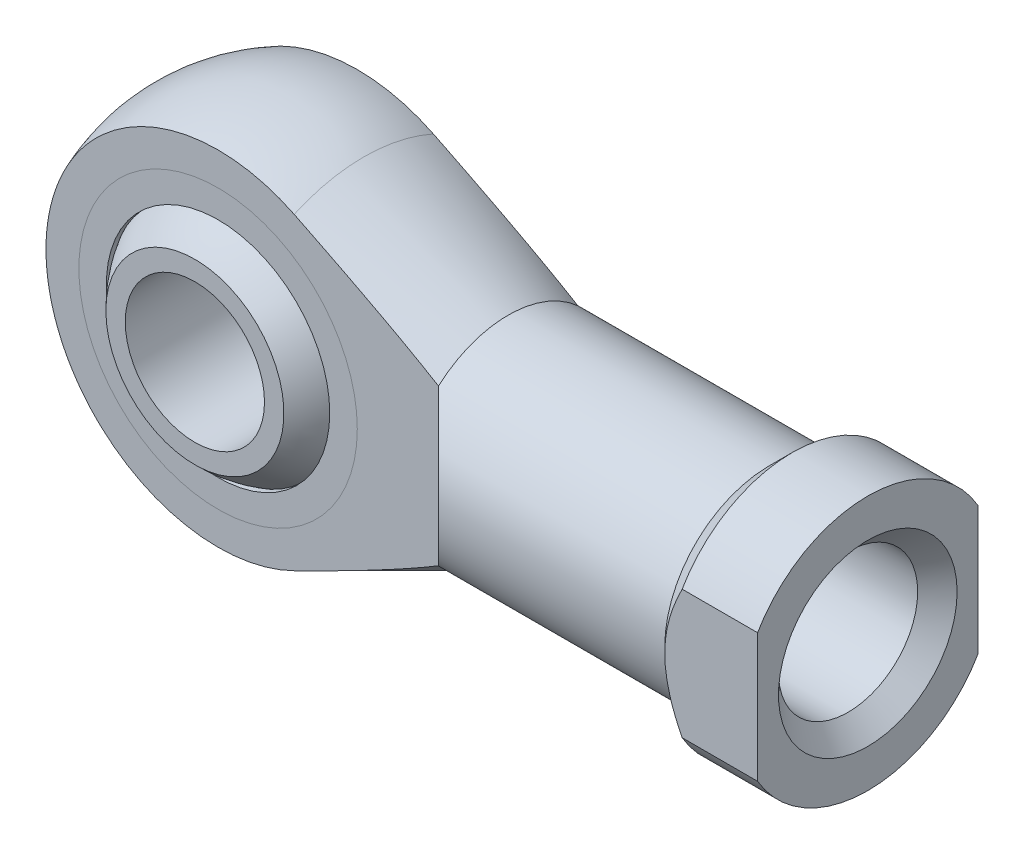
ISO-10303-21;
HEADER;
FILE_DESCRIPTION(('STEP AP214'),'2;1');
FILE_NAME('part.step','',(''),(''),'','','');
FILE_SCHEMA(('AUTOMOTIVE_DESIGN { 1 0 10303 214 1 1 1 1 }'));
ENDSEC;
DATA;
#1=APPLICATION_CONTEXT('core data for automotive mechanical design processes');
#2=APPLICATION_PROTOCOL_DEFINITION('international standard','automotive_design',2000,#1);
#3=PRODUCT_CONTEXT('',#1,'mechanical');
#4=PRODUCT('Part','Part','',(#3));
#5=PRODUCT_RELATED_PRODUCT_CATEGORY('part','',(#4));
#6=PRODUCT_DEFINITION_FORMATION('','',#4);
#7=PRODUCT_DEFINITION_CONTEXT('part definition',#1,'design');
#8=PRODUCT_DEFINITION('design','',#6,#7);
#9=PRODUCT_DEFINITION_SHAPE('','',#8);
#10=(LENGTH_UNIT() NAMED_UNIT(*) SI_UNIT(.MILLI.,.METRE.));
#11=(NAMED_UNIT(*) PLANE_ANGLE_UNIT() SI_UNIT($,.RADIAN.));
#12=(NAMED_UNIT(*) SI_UNIT($,.STERADIAN.) SOLID_ANGLE_UNIT());
#13=UNCERTAINTY_MEASURE_WITH_UNIT(LENGTH_MEASURE(1.E-05),#10,'distance_accuracy_value','');
#14=(GEOMETRIC_REPRESENTATION_CONTEXT(3) GLOBAL_UNCERTAINTY_ASSIGNED_CONTEXT((#13)) GLOBAL_UNIT_ASSIGNED_CONTEXT((#10,
#11,#12)) REPRESENTATION_CONTEXT('',''));
#15=CARTESIAN_POINT('',(0.,0.,0.));
#16=DIRECTION('',(0.,0.,1.));
#17=DIRECTION('',(1.,0.,0.));
#18=AXIS2_PLACEMENT_3D('',#15,#16,#17);
#19=CARTESIAN_POINT('',(0.,0.,0.));
#20=DIRECTION('',(0.,1.,0.));
#21=DIRECTION('',(1.,0.,0.));
#22=AXIS2_PLACEMENT_3D('',#19,#20,#21);
#23=SPHERICAL_SURFACE('',#22,11.085);
#24=CARTESIAN_POINT('',(0.,0.,0.));
#25=DIRECTION('',(0.,0.,-1.));
#26=DIRECTION('',(-1.,0.,0.));
#27=AXIS2_PLACEMENT_3D('',#24,#25,#26);
#28=SPHERICAL_SURFACE('',#27,11.085);
#29=CARTESIAN_POINT('',(0.,0.,8.));
#30=DIRECTION('',(0.,0.,-1.));
#31=DIRECTION('',(-1.,0.,0.));
#32=AXIS2_PLACEMENT_3D('',#29,#30,#31);
#33=CIRCLE('',#32,7.67314961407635);
#34=CARTESIAN_POINT('',(-7.67314961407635,0.,8.));
#35=VERTEX_POINT('',#34);
#36=EDGE_CURVE('P0_E26',#35,#35,#33,.F.);
#37=ORIENTED_EDGE('',*,*,#36,.F.);
#38=EDGE_LOOP('',(#37));
#39=FACE_BOUND('',#38,.T.);
#40=CARTESIAN_POINT('',(0.,0.,-8.));
#41=DIRECTION('',(0.,0.,1.));
#42=DIRECTION('',(1.,0.,0.));
#43=AXIS2_PLACEMENT_3D('',#40,#41,#42);
#44=CIRCLE('',#43,7.67314961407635);
#45=CARTESIAN_POINT('',(7.67314961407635,0.,-8.));
#46=VERTEX_POINT('',#45);
#47=EDGE_CURVE('P0_E10',#46,#46,#44,.F.);
#48=ORIENTED_EDGE('',*,*,#47,.F.);
#49=EDGE_LOOP('',(#48));
#50=FACE_BOUND('',#49,.T.);
#51=ADVANCED_FACE('P0_F14',(#39,#50),#28,.T.);
#52=CARTESIAN_POINT('',(0.,0.,-11.085));
#53=DIRECTION('',(0.,0.,1.));
#54=DIRECTION('',(1.,0.,0.));
#55=AXIS2_PLACEMENT_3D('',#52,#53,#54);
#56=CYLINDRICAL_SURFACE('',#55,6.);
#57=CARTESIAN_POINT('',(0.,0.,8.));
#58=DIRECTION('',(0.,0.,-1.));
#59=DIRECTION('',(-1.,0.,0.));
#60=AXIS2_PLACEMENT_3D('',#57,#58,#59);
#61=CIRCLE('',#60,6.);
#62=CARTESIAN_POINT('',(-6.,0.,8.));
#63=VERTEX_POINT('',#62);
#64=EDGE_CURVE('P0_E17',#63,#63,#61,.F.);
#65=ORIENTED_EDGE('',*,*,#64,.T.);
#66=EDGE_LOOP('',(#65));
#67=FACE_BOUND('',#66,.T.);
#68=CARTESIAN_POINT('',(0.,0.,-8.));
#69=DIRECTION('',(0.,0.,1.));
#70=DIRECTION('',(1.,0.,0.));
#71=AXIS2_PLACEMENT_3D('',#68,#69,#70);
#72=CIRCLE('',#71,6.);
#73=CARTESIAN_POINT('',(6.,0.,-8.));
#74=VERTEX_POINT('',#73);
#75=EDGE_CURVE('P0_E21',#74,#74,#72,.F.);
#76=ORIENTED_EDGE('',*,*,#75,.T.);
#77=EDGE_LOOP('',(#76));
#78=FACE_BOUND('',#77,.T.);
#79=ADVANCED_FACE('P0_F34',(#67,#78),#56,.F.);
#80=CARTESIAN_POINT('',(-11.085,-11.085,-8.));
#81=DIRECTION('',(0.,0.,1.));
#82=DIRECTION('',(1.,0.,0.));
#83=AXIS2_PLACEMENT_3D('',#80,#81,#82);
#84=PLANE('',#83);
#85=ORIENTED_EDGE('',*,*,#47,.T.);
#86=EDGE_LOOP('',(#85));
#87=FACE_BOUND('',#86,.T.);
#88=ORIENTED_EDGE('',*,*,#75,.F.);
#89=EDGE_LOOP('',(#88));
#90=FACE_BOUND('',#89,.T.);
#91=ADVANCED_FACE('P0_F39',(#87,#90),#84,.F.);
#92=CARTESIAN_POINT('',(-11.085,-11.085,8.));
#93=DIRECTION('',(0.,0.,-1.));
#94=DIRECTION('',(-1.,0.,0.));
#95=AXIS2_PLACEMENT_3D('',#92,#93,#94);
#96=PLANE('',#95);
#97=ORIENTED_EDGE('',*,*,#36,.T.);
#98=EDGE_LOOP('',(#97));
#99=FACE_BOUND('',#98,.T.);
#100=ORIENTED_EDGE('',*,*,#64,.F.);
#101=EDGE_LOOP('',(#100));
#102=FACE_BOUND('',#101,.T.);
#103=ADVANCED_FACE('P0_F37',(#99,#102),#96,.F.);
#104=CLOSED_SHELL('',(#51,#79,#91,#103));
#105=MANIFOLD_SOLID_BREP('P0_B1',#104);
#106=CARTESIAN_POINT('',(0.,0.,6.));
#107=DIRECTION('',(0.,0.,1.));
#108=DIRECTION('',(1.,0.,0.));
#109=AXIS2_PLACEMENT_3D('',#106,#107,#108);
#110=PLANE('',#109);
#111=CARTESIAN_POINT('',(0.,0.,6.));
#112=DIRECTION('',(0.,0.,1.));
#113=DIRECTION('',(1.,0.,0.));
#114=AXIS2_PLACEMENT_3D('',#111,#112,#113);
#115=CIRCLE('',#114,12.);
#116=CARTESIAN_POINT('',(12.,0.,6.));
#117=VERTEX_POINT('',#116);
#118=EDGE_CURVE('P1_E10',#117,#117,#115,.T.);
#119=ORIENTED_EDGE('',*,*,#118,.T.);
#120=EDGE_LOOP('',(#119));
#121=FACE_BOUND('',#120,.T.);
#122=CARTESIAN_POINT('',(0.,0.,6.));
#123=DIRECTION('',(0.,0.,1.));
#124=DIRECTION('',(1.,0.,0.));
#125=AXIS2_PLACEMENT_3D('',#122,#123,#124);
#126=CIRCLE('',#125,9.625);
#127=CARTESIAN_POINT('',(9.625,0.,6.));
#128=VERTEX_POINT('',#127);
#129=EDGE_CURVE('P1_E25',#128,#128,#126,.T.);
#130=ORIENTED_EDGE('',*,*,#129,.F.);
#131=EDGE_LOOP('',(#130));
#132=FACE_BOUND('',#131,.T.);
#133=ADVANCED_FACE('P1_F14',(#121,#132),#110,.T.);
#134=CARTESIAN_POINT('',(0.,0.,5.5));
#135=DIRECTION('',(0.,0.,1.));
#136=DIRECTION('',(1.,0.,0.));
#137=AXIS2_PLACEMENT_3D('',#134,#135,#136);
#138=PLANE('',#137);
#139=CARTESIAN_POINT('',(0.,0.,5.5));
#140=DIRECTION('',(0.,0.,1.));
#141=DIRECTION('',(1.,0.,0.));
#142=AXIS2_PLACEMENT_3D('',#139,#140,#141);
#143=CIRCLE('',#142,12.);
#144=CARTESIAN_POINT('',(12.,0.,5.5));
#145=VERTEX_POINT('',#144);
#146=EDGE_CURVE('P1_E18',#145,#145,#143,.T.);
#147=ORIENTED_EDGE('',*,*,#146,.F.);
#148=EDGE_LOOP('',(#147));
#149=FACE_BOUND('',#148,.T.);
#150=CARTESIAN_POINT('',(0.,0.,5.5));
#151=DIRECTION('',(0.,0.,1.));
#152=DIRECTION('',(1.,0.,0.));
#153=AXIS2_PLACEMENT_3D('',#150,#151,#152);
#154=CIRCLE('',#153,9.625);
#155=CARTESIAN_POINT('',(9.625,0.,5.5));
#156=VERTEX_POINT('',#155);
#157=EDGE_CURVE('P1_E27',#156,#156,#154,.T.);
#158=ORIENTED_EDGE('',*,*,#157,.T.);
#159=EDGE_LOOP('',(#158));
#160=FACE_BOUND('',#159,.T.);
#161=ADVANCED_FACE('P1_F37',(#149,#160),#138,.F.);
#162=CARTESIAN_POINT('',(0.,0.,6.));
#163=DIRECTION('',(0.,0.,-1.));
#164=DIRECTION('',(-1.,0.,0.));
#165=AXIS2_PLACEMENT_3D('',#162,#163,#164);
#166=CYLINDRICAL_SURFACE('',#165,12.);
#167=ORIENTED_EDGE('',*,*,#118,.F.);
#168=EDGE_LOOP('',(#167));
#169=FACE_BOUND('',#168,.T.);
#170=ORIENTED_EDGE('',*,*,#146,.T.);
#171=EDGE_LOOP('',(#170));
#172=FACE_BOUND('',#171,.T.);
#173=ADVANCED_FACE('P1_F16',(#169,#172),#166,.T.);
#174=CARTESIAN_POINT('',(0.,0.,6.));
#175=DIRECTION('',(0.,0.,-1.));
#176=DIRECTION('',(-1.,0.,0.));
#177=AXIS2_PLACEMENT_3D('',#174,#175,#176);
#178=CYLINDRICAL_SURFACE('',#177,9.625);
#179=ORIENTED_EDGE('',*,*,#129,.T.);
#180=EDGE_LOOP('',(#179));
#181=FACE_BOUND('',#180,.T.);
#182=ORIENTED_EDGE('',*,*,#157,.F.);
#183=EDGE_LOOP('',(#182));
#184=FACE_BOUND('',#183,.T.);
#185=ADVANCED_FACE('P1_F33',(#181,#184),#178,.F.);
#186=CLOSED_SHELL('',(#133,#161,#173,#185));
#187=MANIFOLD_SOLID_BREP('P1_B1',#186);
#188=CARTESIAN_POINT('',(0.,0.,-5.5));
#189=DIRECTION('',(0.,0.,1.));
#190=DIRECTION('',(1.,0.,0.));
#191=AXIS2_PLACEMENT_3D('',#188,#189,#190);
#192=PLANE('',#191);
#193=CARTESIAN_POINT('',(0.,0.,-5.5));
#194=DIRECTION('',(0.,0.,1.));
#195=DIRECTION('',(1.,0.,0.));
#196=AXIS2_PLACEMENT_3D('',#193,#194,#195);
#197=CIRCLE('',#196,12.);
#198=CARTESIAN_POINT('',(12.,0.,-5.5));
#199=VERTEX_POINT('',#198);
#200=EDGE_CURVE('P2_E10',#199,#199,#197,.T.);
#201=ORIENTED_EDGE('',*,*,#200,.T.);
#202=EDGE_LOOP('',(#201));
#203=FACE_BOUND('',#202,.T.);
#204=CARTESIAN_POINT('',(0.,0.,-5.5));
#205=DIRECTION('',(0.,0.,1.));
#206=DIRECTION('',(1.,0.,0.));
#207=AXIS2_PLACEMENT_3D('',#204,#205,#206);
#208=CIRCLE('',#207,9.625);
#209=CARTESIAN_POINT('',(9.625,0.,-5.5));
#210=VERTEX_POINT('',#209);
#211=EDGE_CURVE('P2_E25',#210,#210,#208,.T.);
#212=ORIENTED_EDGE('',*,*,#211,.F.);
#213=EDGE_LOOP('',(#212));
#214=FACE_BOUND('',#213,.T.);
#215=ADVANCED_FACE('P2_F14',(#203,#214),#192,.T.);
#216=CARTESIAN_POINT('',(0.,0.,-6.));
#217=DIRECTION('',(0.,0.,1.));
#218=DIRECTION('',(1.,0.,0.));
#219=AXIS2_PLACEMENT_3D('',#216,#217,#218);
#220=PLANE('',#219);
#221=CARTESIAN_POINT('',(0.,0.,-6.));
#222=DIRECTION('',(0.,0.,1.));
#223=DIRECTION('',(1.,0.,0.));
#224=AXIS2_PLACEMENT_3D('',#221,#222,#223);
#225=CIRCLE('',#224,12.);
#226=CARTESIAN_POINT('',(12.,0.,-6.));
#227=VERTEX_POINT('',#226);
#228=EDGE_CURVE('P2_E18',#227,#227,#225,.T.);
#229=ORIENTED_EDGE('',*,*,#228,.F.);
#230=EDGE_LOOP('',(#229));
#231=FACE_BOUND('',#230,.T.);
#232=CARTESIAN_POINT('',(0.,0.,-6.));
#233=DIRECTION('',(0.,0.,1.));
#234=DIRECTION('',(1.,0.,0.));
#235=AXIS2_PLACEMENT_3D('',#232,#233,#234);
#236=CIRCLE('',#235,9.625);
#237=CARTESIAN_POINT('',(9.625,0.,-6.));
#238=VERTEX_POINT('',#237);
#239=EDGE_CURVE('P2_E27',#238,#238,#236,.T.);
#240=ORIENTED_EDGE('',*,*,#239,.T.);
#241=EDGE_LOOP('',(#240));
#242=FACE_BOUND('',#241,.T.);
#243=ADVANCED_FACE('P2_F37',(#231,#242),#220,.F.);
#244=CARTESIAN_POINT('',(0.,0.,-5.5));
#245=DIRECTION('',(0.,0.,-1.));
#246=DIRECTION('',(-1.,0.,0.));
#247=AXIS2_PLACEMENT_3D('',#244,#245,#246);
#248=CYLINDRICAL_SURFACE('',#247,12.);
#249=ORIENTED_EDGE('',*,*,#200,.F.);
#250=EDGE_LOOP('',(#249));
#251=FACE_BOUND('',#250,.T.);
#252=ORIENTED_EDGE('',*,*,#228,.T.);
#253=EDGE_LOOP('',(#252));
#254=FACE_BOUND('',#253,.T.);
#255=ADVANCED_FACE('P2_F16',(#251,#254),#248,.T.);
#256=CARTESIAN_POINT('',(0.,0.,-5.5));
#257=DIRECTION('',(0.,0.,-1.));
#258=DIRECTION('',(-1.,0.,0.));
#259=AXIS2_PLACEMENT_3D('',#256,#257,#258);
#260=CYLINDRICAL_SURFACE('',#259,9.625);
#261=ORIENTED_EDGE('',*,*,#211,.T.);
#262=EDGE_LOOP('',(#261));
#263=FACE_BOUND('',#262,.T.);
#264=ORIENTED_EDGE('',*,*,#239,.F.);
#265=EDGE_LOOP('',(#264));
#266=FACE_BOUND('',#265,.T.);
#267=ADVANCED_FACE('P2_F33',(#263,#266),#260,.F.);
#268=CLOSED_SHELL('',(#215,#243,#255,#267));
#269=MANIFOLD_SOLID_BREP('P2_B1',#268);
#270=CARTESIAN_POINT('',(0.,0.,0.));
#271=DIRECTION('',(0.,1.,0.));
#272=DIRECTION('',(1.,0.,0.));
#273=AXIS2_PLACEMENT_3D('',#270,#271,#272);
#274=SPHERICAL_SURFACE('',#273,11.085);
#275=CARTESIAN_POINT('',(0.,0.,0.));
#276=DIRECTION('',(0.,0.,1.));
#277=DIRECTION('',(1.,0.,0.));
#278=AXIS2_PLACEMENT_3D('',#275,#276,#277);
#279=SPHERICAL_SURFACE('',#278,11.085);
#280=CARTESIAN_POINT('',(0.,0.,5.5));
#281=DIRECTION('',(0.,0.,1.));
#282=DIRECTION('',(1.,0.,0.));
#283=AXIS2_PLACEMENT_3D('',#280,#281,#282);
#284=CIRCLE('',#283,9.6243038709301);
#285=CARTESIAN_POINT('',(9.6243038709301,0.,5.5));
#286=VERTEX_POINT('',#285);
#287=EDGE_CURVE('P3_E73',#286,#286,#284,.F.);
#288=ORIENTED_EDGE('',*,*,#287,.F.);
#289=EDGE_LOOP('',(#288));
#290=FACE_BOUND('',#289,.T.);
#291=CARTESIAN_POINT('',(0.,0.,-5.5));
#292=DIRECTION('',(0.,0.,-1.));
#293=DIRECTION('',(-1.,0.,0.));
#294=AXIS2_PLACEMENT_3D('',#291,#292,#293);
#295=CIRCLE('',#294,9.6243038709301);
#296=CARTESIAN_POINT('',(-9.6243038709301,0.,-5.5));
#297=VERTEX_POINT('',#296);
#298=EDGE_CURVE('P3_E20',#297,#297,#295,.F.);
#299=ORIENTED_EDGE('',*,*,#298,.F.);
#300=EDGE_LOOP('',(#299));
#301=FACE_BOUND('',#300,.T.);
#302=ADVANCED_FACE('P3_F16',(#290,#301),#279,.F.);
#303=CARTESIAN_POINT('',(-19.,-16.,-6.));
#304=DIRECTION('',(0.,0.,1.));
#305=DIRECTION('',(1.,0.,0.));
#306=AXIS2_PLACEMENT_3D('',#303,#304,#305);
#307=PLANE('',#306);
#308=CARTESIAN_POINT('',(0.,0.,-6.));
#309=DIRECTION('',(0.,0.,1.));
#310=DIRECTION('',(1.,0.,0.));
#311=AXIS2_PLACEMENT_3D('',#308,#309,#310);
#312=CIRCLE('',#311,14.8323969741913);
#313=CARTESIAN_POINT('',(6.56131637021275,13.3022226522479,-6.));
#314=VERTEX_POINT('',#313);
#315=CARTESIAN_POINT('',(6.56131637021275,-13.3022226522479,-6.));
#316=VERTEX_POINT('',#315);
#317=EDGE_CURVE('P3_E11',#314,#316,#312,.T.);
#318=ORIENTED_EDGE('',*,*,#317,.F.);
#319=CARTESIAN_POINT('',(-12.4742782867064,-22.3607140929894,-6.));
#320=CARTESIAN_POINT('',(-11.8607994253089,-22.0751178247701,-6.));
#321=CARTESIAN_POINT('',(-11.2474597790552,-21.789222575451,-6.));
#322=CARTESIAN_POINT('',(-10.0210971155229,-21.2167529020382,-6.));
#323=CARTESIAN_POINT('',(-9.40807409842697,-20.9301784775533,-6.));
#324=CARTESIAN_POINT('',(-7.56949609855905,-20.0692953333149,-6.));
#325=CARTESIAN_POINT('',(-6.34447446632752,-19.4938464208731,-6.));
#326=CARTESIAN_POINT('',(-3.89463951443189,-18.338251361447,-6.));
#327=CARTESIAN_POINT('',(-2.66982867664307,-17.7580999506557,-6.));
#328=CARTESIAN_POINT('',(-0.222712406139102,-16.5926127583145,-6.));
#329=CARTESIAN_POINT('',(0.999593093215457,-16.0072771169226,-6.));
#330=CARTESIAN_POINT('',(2.84328087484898,-15.1177384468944,-6.));
#331=CARTESIAN_POINT('',(3.46593633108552,-14.8161743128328,-6.));
#332=CARTESIAN_POINT('',(4.71016233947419,-14.2108170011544,-6.));
#333=CARTESIAN_POINT('',(5.33173289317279,-13.9070238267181,-6.));
#334=CARTESIAN_POINT('',(6.57361052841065,-13.2967288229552,-6.));
#335=CARTESIAN_POINT('',(7.19391749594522,-12.9902267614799,-6.));
#336=CARTESIAN_POINT('',(8.43290015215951,-12.3739463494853,-6.));
#337=CARTESIAN_POINT('',(9.05157584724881,-12.0641680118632,-6.));
#338=CARTESIAN_POINT('',(10.2864969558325,-11.4407381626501,-6.));
#339=CARTESIAN_POINT('',(10.9027436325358,-11.1270891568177,-6.));
#340=CARTESIAN_POINT('',(12.1325946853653,-10.4946593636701,-6.));
#341=CARTESIAN_POINT('',(12.746199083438,-10.1758786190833,-6.));
#342=CARTESIAN_POINT('',(13.96984897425,-9.53173324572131,-6.));
#343=CARTESIAN_POINT('',(14.5798949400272,-9.20636951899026,-6.));
#344=CARTESIAN_POINT('',(15.4913555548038,-8.71170109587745,-6.));
#345=CARTESIAN_POINT('',(15.7945694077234,-8.54571060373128,-6.));
#346=CARTESIAN_POINT('',(16.3995611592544,-8.21113489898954,-6.));
#347=CARTESIAN_POINT('',(16.7013390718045,-8.04254971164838,-6.));
#348=CARTESIAN_POINT('',(17.1550740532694,-7.78603819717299,-6.));
#349=CARTESIAN_POINT('',(17.3076735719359,-7.69924760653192,-6.));
#350=CARTESIAN_POINT('',(17.6123777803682,-7.52480052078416,-6.));
#351=CARTESIAN_POINT('',(17.7644824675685,-7.43714402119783,-6.));
#352=CARTESIAN_POINT('',(18.2199860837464,-7.17274974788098,-6.));
#353=CARTESIAN_POINT('',(18.5225643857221,-6.99459294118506,-6.));
#354=CARTESIAN_POINT('',(19.1242565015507,-6.63412618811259,-6.));
#355=CARTESIAN_POINT('',(19.4233768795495,-6.45182721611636,-6.));
#356=CARTESIAN_POINT('',(20.0181200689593,-6.08161412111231,-6.));
#357=CARTESIAN_POINT('',(20.3137430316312,-5.89370024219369,-6.));
#358=CARTESIAN_POINT('',(20.8137062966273,-5.56737766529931,-6.));
#359=CARTESIAN_POINT('',(21.0192070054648,-5.43074868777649,-6.));
#360=CARTESIAN_POINT('',(21.4273643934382,-5.15331238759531,-6.));
#361=CARTESIAN_POINT('',(21.6300211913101,-5.0125052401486,-6.));
#362=CARTESIAN_POINT('',(22.032578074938,-4.72526751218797,-6.));
#363=CARTESIAN_POINT('',(22.2324634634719,-4.57881625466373,-6.));
#364=CARTESIAN_POINT('',(22.6275245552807,-4.27973406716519,-6.));
#365=CARTESIAN_POINT('',(22.8227010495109,-4.12710418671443,-6.));
#366=CARTESIAN_POINT('',(23.2089243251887,-3.81244139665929,-6.));
#367=CARTESIAN_POINT('',(23.3999029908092,-3.65032419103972,-6.));
#368=CARTESIAN_POINT('',(23.7731984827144,-3.31602666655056,-6.));
#369=CARTESIAN_POINT('',(23.9555077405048,-3.14383783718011,-6.));
#370=CARTESIAN_POINT('',(24.306480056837,-2.78768970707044,-6.));
#371=CARTESIAN_POINT('',(24.4752139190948,-2.60380184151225,-6.));
#372=CARTESIAN_POINT('',(24.7137904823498,-2.31615709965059,-6.));
#373=CARTESIAN_POINT('',(24.7908433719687,-2.2183837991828,-6.));
#374=CARTESIAN_POINT('',(24.938925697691,-2.018400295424,-6.));
#375=CARTESIAN_POINT('',(25.0099577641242,-1.9161920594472,-6.));
#376=CARTESIAN_POINT('',(25.1285556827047,-1.73169204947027,-6.));
#377=CARTESIAN_POINT('',(25.1776946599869,-1.65041700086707,-6.));
#378=CARTESIAN_POINT('',(25.2707382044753,-1.48493595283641,-6.));
#379=CARTESIAN_POINT('',(25.3146424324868,-1.40072976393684,-6.));
#380=CARTESIAN_POINT('',(25.4369101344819,-1.14389033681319,-6.));
#381=CARTESIAN_POINT('',(25.506102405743,-0.966626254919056,-6.));
#382=CARTESIAN_POINT('',(25.602214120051,-0.633227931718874,-6.));
#383=CARTESIAN_POINT('',(25.6343135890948,-0.478610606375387,-6.));
#384=CARTESIAN_POINT('',(25.6715666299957,-0.166128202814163,-6.));
#385=CARTESIAN_POINT('',(25.6767387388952,-0.00826543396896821,-6.));
#386=CARTESIAN_POINT('',(25.6594326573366,0.305801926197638,-6.));
#387=CARTESIAN_POINT('',(25.6369681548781,0.462007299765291,-6.));
#388=CARTESIAN_POINT('',(25.5673950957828,0.768776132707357,-6.));
#389=CARTESIAN_POINT('',(25.5202603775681,0.919333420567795,-6.));
#390=CARTESIAN_POINT('',(25.3749209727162,1.29299346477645,-6.));
#391=CARTESIAN_POINT('',(25.262884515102,1.51066591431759,-6.));
#392=CARTESIAN_POINT('',(25.0718664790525,1.82262659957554,-6.));
#393=CARTESIAN_POINT('',(25.0042038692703,1.92438271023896,-6.));
#394=CARTESIAN_POINT('',(24.8626595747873,2.12348650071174,-6.));
#395=CARTESIAN_POINT('',(24.7887793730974,2.220835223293,-6.));
#396=CARTESIAN_POINT('',(24.6008380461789,2.45549886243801,-6.));
#397=CARTESIAN_POINT('',(24.4839597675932,2.59054035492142,-6.));
#398=CARTESIAN_POINT('',(24.2423637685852,2.85346812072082,-6.));
#399=CARTESIAN_POINT('',(24.1176418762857,2.98135051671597,-6.));
#400=CARTESIAN_POINT('',(23.8620670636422,3.23129963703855,-6.));
#401=CARTESIAN_POINT('',(23.7312028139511,3.35335470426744,-6.));
#402=CARTESIAN_POINT('',(23.4648993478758,3.59237469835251,-6.));
#403=CARTESIAN_POINT('',(23.3294595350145,3.70933895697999,-6.));
#404=CARTESIAN_POINT('',(23.054072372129,3.93971586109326,-6.));
#405=CARTESIAN_POINT('',(22.9141010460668,4.05309973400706,-6.));
#406=CARTESIAN_POINT('',(22.6312295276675,4.27615236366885,-6.));
#407=CARTESIAN_POINT('',(22.4883292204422,4.38582097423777,-6.));
#408=CARTESIAN_POINT('',(22.2003327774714,4.60182755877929,-6.));
#409=CARTESIAN_POINT('',(22.0552397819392,4.70816972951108,-6.));
#410=CARTESIAN_POINT('',(21.7630853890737,4.91809599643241,-6.));
#411=CARTESIAN_POINT('',(21.6160240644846,5.02168019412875,-6.));
#412=CARTESIAN_POINT('',(21.1311337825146,5.35741587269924,-6.));
#413=CARTESIAN_POINT('',(20.7898498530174,5.58458125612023,-6.));
#414=CARTESIAN_POINT('',(20.1013145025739,6.02970959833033,-6.));
#415=CARTESIAN_POINT('',(19.7540621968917,6.24767117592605,-6.));
#416=CARTESIAN_POINT('',(19.0550354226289,6.67656219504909,-6.));
#417=CARTESIAN_POINT('',(18.703258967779,6.8874883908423,-6.));
#418=CARTESIAN_POINT('',(17.9963884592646,7.30371053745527,-6.));
#419=CARTESIAN_POINT('',(17.6412943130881,7.50900633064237,-6.));
#420=CARTESIAN_POINT('',(16.9278454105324,7.91544168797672,-6.));
#421=CARTESIAN_POINT('',(16.5694857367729,8.1165726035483,-6.));
#422=CARTESIAN_POINT('',(15.8506943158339,8.51510143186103,-6.));
#423=CARTESIAN_POINT('',(15.4902625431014,8.71249929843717,-6.));
#424=CARTESIAN_POINT('',(14.7678207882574,9.10413633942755,-6.));
#425=CARTESIAN_POINT('',(14.405811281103,9.29837639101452,-6.));
#426=CARTESIAN_POINT('',(13.6804018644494,9.68424441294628,-6.));
#427=CARTESIAN_POINT('',(13.3170019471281,9.87587236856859,-6.));
#428=CARTESIAN_POINT('',(12.2271121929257,10.4463738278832,-6.));
#429=CARTESIAN_POINT('',(11.4989012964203,10.8219596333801,-6.));
#430=CARTESIAN_POINT('',(10.0391193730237,11.5666423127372,-6.));
#431=CARTESIAN_POINT('',(9.30754812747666,11.9357387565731,-6.));
#432=CARTESIAN_POINT('',(7.84264526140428,12.6685592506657,-6.));
#433=CARTESIAN_POINT('',(7.10931616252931,13.0322883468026,-6.));
#434=CARTESIAN_POINT('',(5.64072790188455,13.7558296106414,-6.));
#435=CARTESIAN_POINT('',(4.90546873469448,14.1156417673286,-6.));
#436=CARTESIAN_POINT('',(3.47919379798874,14.809851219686,-6.));
#437=CARTESIAN_POINT('',(2.78826997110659,15.1444375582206,-6.));
#438=CARTESIAN_POINT('',(1.40532103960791,15.8113333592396,-6.));
#439=CARTESIAN_POINT('',(0.71329592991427,16.1436428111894,-6.));
#440=CARTESIAN_POINT('',(-1.36457436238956,17.1379506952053,-6.));
#441=CARTESIAN_POINT('',(-2.75177536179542,17.7971155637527,-6.));
#442=CARTESIAN_POINT('',(-5.52736918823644,19.1093977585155,-6.));
#443=CARTESIAN_POINT('',(-6.91575951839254,19.7625203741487,-6.));
#444=CARTESIAN_POINT('',(-8.99952561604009,20.739067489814,-6.));
#445=CARTESIAN_POINT('',(-9.69419273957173,21.0640053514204,-6.));
#446=CARTESIAN_POINT('',(-11.0839400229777,21.7129942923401,-6.));
#447=CARTESIAN_POINT('',(-11.7790201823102,22.0370453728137,-6.));
#448=CARTESIAN_POINT('',(-12.4742782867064,22.3607140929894,-6.));
#449=B_SPLINE_CURVE_WITH_KNOTS('',3,(#319,#320,#321,#322,#323,#324,#325,#326,#327,#328,#329,
#330,#331,#332,#333,#334,#335,#336,#337,#338,#339,#340,#341,#342,#343,#344,#345,#346,#347,#348,
#349,#350,#351,#352,#353,#354,#355,#356,#357,#358,#359,#360,#361,#362,#363,#364,#365,#366,#367,
#368,#369,#370,#371,#372,#373,#374,#375,#376,#377,#378,#379,#380,#381,#382,#383,#384,#385,#386,
#387,#388,#389,#390,#391,#392,#393,#394,#395,#396,#397,#398,#399,#400,#401,#402,#403,#404,#405,
#406,#407,#408,#409,#410,#411,#412,#413,#414,#415,#416,#417,#418,#419,#420,#421,#422,#423,#424,
#425,#426,#427,#428,#429,#430,#431,#432,#433,#434,#435,#436,#437,#438,#439,#440,#441,#442,#443,
#444,#445,#446,#447,#448),.UNSPECIFIED.,.F.,.F.,(4,2,2,2,2,2,2,2,2,2,2,2,2,2,2,2,2,2,2,2,2,2,2,
2,2,2,2,2,2,2,2,2,2,2,2,2,2,2,2,2,2,2,2,2,2,2,2,2,2,2,2,2,2,2,2,2,2,2,2,2,2,2,2,2,4),(0.,
2.03009682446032,4.0601948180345,8.12053076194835,12.1863111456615,16.2519819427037,
18.327494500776,20.4030040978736,22.4786933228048,24.5543743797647,26.6287756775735,
28.7031597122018,30.7772614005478,31.8142780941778,32.8512847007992,33.377944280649,
33.9046065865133,34.9579662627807,36.0088019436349,37.0595920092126,37.7998767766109,
38.5401305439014,39.2834173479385,40.0265784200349,40.7778322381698,41.5297303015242,
42.277411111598,42.6506966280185,43.0238182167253,43.3085624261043,43.5933250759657,
44.1613827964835,44.6330733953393,45.1044392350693,45.5755717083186,46.0472048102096,
46.7771513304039,47.1436327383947,47.5100269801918,48.0453965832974,48.5810533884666,
49.1177403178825,49.6544974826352,50.1948221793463,50.7351681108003,51.2748023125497,
51.8144166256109,53.0441041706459,54.2739756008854,55.5044067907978,56.7348723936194,
57.9676785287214,59.2004998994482,60.4329727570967,61.6654525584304,64.1234908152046,
66.5816913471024,69.0374110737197,71.493137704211,73.7961554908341,76.0991839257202,
80.706705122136,85.3097149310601,87.6104367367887,89.9111555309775),.UNSPECIFIED.);
#450=CARTESIAN_POINT('',(19.,6.70820393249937,-6.));
#451=VERTEX_POINT('',#450);
#452=EDGE_CURVE('P3_E102',#451,#314,#449,.T.);
#453=ORIENTED_EDGE('',*,*,#452,.F.);
#454=DIRECTION('',(0.,1.,0.));
#455=VECTOR('',#454,1.);
#456=CARTESIAN_POINT('',(19.,-16.,-6.));
#457=LINE('',#456,#455);
#458=CARTESIAN_POINT('',(19.,-6.70820393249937,-6.));
#459=VERTEX_POINT('',#458);
#460=EDGE_CURVE('P3_E64',#459,#451,#457,.T.);
#461=ORIENTED_EDGE('',*,*,#460,.F.);
#462=EDGE_CURVE('P3_E33',#316,#459,#449,.T.);
#463=ORIENTED_EDGE('',*,*,#462,.F.);
#464=EDGE_LOOP('',(#318,#453,#461,#463));
#465=FACE_BOUND('',#464,.T.);
#466=CARTESIAN_POINT('',(0.,0.,-6.));
#467=DIRECTION('',(0.,0.,1.));
#468=DIRECTION('',(1.,0.,0.));
#469=AXIS2_PLACEMENT_3D('',#466,#467,#468);
#470=CIRCLE('',#469,12.);
#471=CARTESIAN_POINT('',(12.,0.,-6.));
#472=VERTEX_POINT('',#471);
#473=EDGE_CURVE('P3_E95',#472,#472,#470,.T.);
#474=ORIENTED_EDGE('',*,*,#473,.T.);
#475=EDGE_LOOP('',(#474));
#476=FACE_BOUND('',#475,.T.);
#477=ADVANCED_FACE('P3_F115',(#465,#476),#307,.F.);
#478=CARTESIAN_POINT('',(19.,0.,0.));
#479=DIRECTION('',(-1.,0.,0.));
#480=DIRECTION('',(0.,0.,1.));
#481=AXIS2_PLACEMENT_3D('',#478,#479,#480);
#482=CONICAL_SURFACE('',#481,9.,0.422544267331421);
#483=CARTESIAN_POINT('',(6.56131637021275,0.,0.));
#484=DIRECTION('',(-1.,0.,0.));
#485=DIRECTION('',(0.,0.,1.));
#486=AXIS2_PLACEMENT_3D('',#483,#484,#485);
#487=CIRCLE('',#486,14.5927765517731);
#488=CARTESIAN_POINT('',(6.56131637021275,-13.3022226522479,6.));
#489=VERTEX_POINT('',#488);
#490=EDGE_CURVE('P3_E79',#316,#489,#487,.T.);
#491=ORIENTED_EDGE('',*,*,#490,.F.);
#492=ORIENTED_EDGE('',*,*,#462,.T.);
#493=CARTESIAN_POINT('',(19.,0.,0.));
#494=DIRECTION('',(-1.,0.,0.));
#495=DIRECTION('',(0.,0.,1.));
#496=AXIS2_PLACEMENT_3D('',#493,#494,#495);
#497=CIRCLE('',#496,9.);
#498=CARTESIAN_POINT('',(19.,-6.70820393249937,6.));
#499=VERTEX_POINT('',#498);
#500=EDGE_CURVE('P3_E70',#459,#499,#497,.T.);
#501=ORIENTED_EDGE('',*,*,#500,.T.);
#502=CARTESIAN_POINT('',(-12.4742782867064,22.3607140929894,6.));
#503=CARTESIAN_POINT('',(-11.8607994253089,22.0751178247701,6.));
#504=CARTESIAN_POINT('',(-11.2474597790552,21.789222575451,6.));
#505=CARTESIAN_POINT('',(-10.0210971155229,21.2167529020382,6.));
#506=CARTESIAN_POINT('',(-9.40807409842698,20.9301784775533,6.));
#507=CARTESIAN_POINT('',(-7.56949609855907,20.0692953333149,6.));
#508=CARTESIAN_POINT('',(-6.34447446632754,19.4938464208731,6.));
#509=CARTESIAN_POINT('',(-3.89463951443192,18.338251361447,6.));
#510=CARTESIAN_POINT('',(-2.66982867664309,17.7580999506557,6.));
#511=CARTESIAN_POINT('',(-0.222712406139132,16.5926127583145,6.));
#512=CARTESIAN_POINT('',(0.999593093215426,16.0072771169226,6.));
#513=CARTESIAN_POINT('',(2.84328087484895,15.1177384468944,6.));
#514=CARTESIAN_POINT('',(3.46593633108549,14.8161743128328,6.));
#515=CARTESIAN_POINT('',(4.71016233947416,14.2108170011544,6.));
#516=CARTESIAN_POINT('',(5.33173289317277,13.9070238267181,6.));
#517=CARTESIAN_POINT('',(6.57361052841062,13.2967288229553,6.));
#518=CARTESIAN_POINT('',(7.1939174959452,12.9902267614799,6.));
#519=CARTESIAN_POINT('',(8.43290015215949,12.3739463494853,6.));
#520=CARTESIAN_POINT('',(9.05157584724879,12.0641680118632,6.));
#521=CARTESIAN_POINT('',(10.2864969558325,11.4407381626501,6.));
#522=CARTESIAN_POINT('',(10.9027436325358,11.1270891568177,6.));
#523=CARTESIAN_POINT('',(12.1325946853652,10.4946593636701,6.));
#524=CARTESIAN_POINT('',(12.746199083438,10.1758786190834,6.));
#525=CARTESIAN_POINT('',(13.96984897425,9.53173324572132,6.));
#526=CARTESIAN_POINT('',(14.5798949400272,9.20636951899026,6.));
#527=CARTESIAN_POINT('',(15.4913555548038,8.71170109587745,6.));
#528=CARTESIAN_POINT('',(15.7945694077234,8.54571060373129,6.));
#529=CARTESIAN_POINT('',(16.3995611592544,8.21113489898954,6.));
#530=CARTESIAN_POINT('',(16.7013390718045,8.04254971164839,6.));
#531=CARTESIAN_POINT('',(17.1550740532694,7.78603819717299,6.));
#532=CARTESIAN_POINT('',(17.3076735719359,7.69924760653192,6.));
#533=CARTESIAN_POINT('',(17.6123777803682,7.52480052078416,6.));
#534=CARTESIAN_POINT('',(17.7644824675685,7.43714402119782,6.));
#535=CARTESIAN_POINT('',(18.2199860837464,7.17274974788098,6.));
#536=CARTESIAN_POINT('',(18.5225643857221,6.99459294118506,6.));
#537=CARTESIAN_POINT('',(19.1242565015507,6.63412618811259,6.));
#538=CARTESIAN_POINT('',(19.4233768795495,6.45182721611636,6.));
#539=CARTESIAN_POINT('',(20.0181200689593,6.08161412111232,6.));
#540=CARTESIAN_POINT('',(20.3137430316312,5.89370024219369,6.));
#541=CARTESIAN_POINT('',(20.8137062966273,5.56737766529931,6.));
#542=CARTESIAN_POINT('',(21.0192070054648,5.43074868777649,6.));
#543=CARTESIAN_POINT('',(21.4273643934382,5.15331238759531,6.));
#544=CARTESIAN_POINT('',(21.6300211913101,5.0125052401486,6.));
#545=CARTESIAN_POINT('',(22.032578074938,4.72526751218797,6.));
#546=CARTESIAN_POINT('',(22.2324634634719,4.57881625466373,6.));
#547=CARTESIAN_POINT('',(22.6275245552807,4.27973406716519,6.));
#548=CARTESIAN_POINT('',(22.822701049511,4.12710418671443,6.));
#549=CARTESIAN_POINT('',(23.2089243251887,3.81244139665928,6.));
#550=CARTESIAN_POINT('',(23.3999029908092,3.65032419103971,6.));
#551=CARTESIAN_POINT('',(23.7731984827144,3.31602666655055,6.));
#552=CARTESIAN_POINT('',(23.9555077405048,3.1438378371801,6.));
#553=CARTESIAN_POINT('',(24.306480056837,2.78768970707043,6.));
#554=CARTESIAN_POINT('',(24.4752139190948,2.60380184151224,6.));
#555=CARTESIAN_POINT('',(24.7137904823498,2.31615709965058,6.));
#556=CARTESIAN_POINT('',(24.7908433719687,2.21838379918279,6.));
#557=CARTESIAN_POINT('',(24.9389256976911,2.01840029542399,6.));
#558=CARTESIAN_POINT('',(25.0099577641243,1.91619205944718,6.));
#559=CARTESIAN_POINT('',(25.1285556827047,1.73169204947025,6.));
#560=CARTESIAN_POINT('',(25.1776946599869,1.65041700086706,6.));
#561=CARTESIAN_POINT('',(25.2707382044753,1.48493595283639,6.));
#562=CARTESIAN_POINT('',(25.3146424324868,1.40072976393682,6.));
#563=CARTESIAN_POINT('',(25.4369101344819,1.14389033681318,6.));
#564=CARTESIAN_POINT('',(25.506102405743,0.966626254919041,6.));
#565=CARTESIAN_POINT('',(25.602214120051,0.633227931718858,6.));
#566=CARTESIAN_POINT('',(25.6343135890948,0.478610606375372,6.));
#567=CARTESIAN_POINT('',(25.6715666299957,0.166128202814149,6.));
#568=CARTESIAN_POINT('',(25.6767387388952,0.00826543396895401,6.));
#569=CARTESIAN_POINT('',(25.6594326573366,-0.305801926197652,6.));
#570=CARTESIAN_POINT('',(25.6369681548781,-0.462007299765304,6.));
#571=CARTESIAN_POINT('',(25.5673950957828,-0.76877613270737,6.));
#572=CARTESIAN_POINT('',(25.5202603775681,-0.919333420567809,6.));
#573=CARTESIAN_POINT('',(25.3749209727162,-1.29299346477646,6.));
#574=CARTESIAN_POINT('',(25.262884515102,-1.5106659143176,6.));
#575=CARTESIAN_POINT('',(25.0718664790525,-1.82262659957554,6.));
#576=CARTESIAN_POINT('',(25.0042038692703,-1.92438271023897,6.));
#577=CARTESIAN_POINT('',(24.8626595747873,-2.12348650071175,6.));
#578=CARTESIAN_POINT('',(24.7887793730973,-2.22083522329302,6.));
#579=CARTESIAN_POINT('',(24.6008380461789,-2.45549886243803,6.));
#580=CARTESIAN_POINT('',(24.4839597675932,-2.59054035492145,6.));
#581=CARTESIAN_POINT('',(24.2423637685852,-2.85346812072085,6.));
#582=CARTESIAN_POINT('',(24.1176418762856,-2.981350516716,6.));
#583=CARTESIAN_POINT('',(23.8620670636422,-3.23129963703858,6.));
#584=CARTESIAN_POINT('',(23.7312028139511,-3.35335470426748,6.));
#585=CARTESIAN_POINT('',(23.4648993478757,-3.59237469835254,6.));
#586=CARTESIAN_POINT('',(23.3294595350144,-3.70933895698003,6.));
#587=CARTESIAN_POINT('',(23.0540723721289,-3.9397158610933,6.));
#588=CARTESIAN_POINT('',(22.9141010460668,-4.0530997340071,6.));
#589=CARTESIAN_POINT('',(22.6312295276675,-4.27615236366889,6.));
#590=CARTESIAN_POINT('',(22.4883292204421,-4.38582097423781,6.));
#591=CARTESIAN_POINT('',(22.2003327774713,-4.60182755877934,6.));
#592=CARTESIAN_POINT('',(22.0552397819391,-4.70816972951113,6.));
#593=CARTESIAN_POINT('',(21.7630853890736,-4.91809599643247,6.));
#594=CARTESIAN_POINT('',(21.6160240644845,-5.0216801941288,6.));
#595=CARTESIAN_POINT('',(21.1311337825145,-5.35741587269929,6.));
#596=CARTESIAN_POINT('',(20.7898498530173,-5.58458125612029,6.));
#597=CARTESIAN_POINT('',(20.1013145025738,-6.02970959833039,6.));
#598=CARTESIAN_POINT('',(19.7540621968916,-6.24767117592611,6.));
#599=CARTESIAN_POINT('',(19.0550354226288,-6.67656219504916,6.));
#600=CARTESIAN_POINT('',(18.7032589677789,-6.88748839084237,6.));
#601=CARTESIAN_POINT('',(17.9963884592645,-7.30371053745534,6.));
#602=CARTESIAN_POINT('',(17.641294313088,-7.50900633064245,6.));
#603=CARTESIAN_POINT('',(16.9278454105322,-7.9154416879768,6.));
#604=CARTESIAN_POINT('',(16.5694857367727,-8.11657260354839,6.));
#605=CARTESIAN_POINT('',(15.8506943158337,-8.51510143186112,6.));
#606=CARTESIAN_POINT('',(15.4902625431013,-8.71249929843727,6.));
#607=CARTESIAN_POINT('',(14.7678207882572,-9.10413633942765,6.));
#608=CARTESIAN_POINT('',(14.4058112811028,-9.29837639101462,6.));
#609=CARTESIAN_POINT('',(13.6804018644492,-9.68424441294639,6.));
#610=CARTESIAN_POINT('',(13.3170019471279,-9.87587236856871,6.));
#611=CARTESIAN_POINT('',(12.2271121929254,-10.4463738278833,6.));
#612=CARTESIAN_POINT('',(11.49890129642,-10.8219596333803,6.));
#613=CARTESIAN_POINT('',(10.0391193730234,-11.5666423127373,6.));
#614=CARTESIAN_POINT('',(9.30754812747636,-11.9357387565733,6.));
#615=CARTESIAN_POINT('',(7.84264526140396,-12.6685592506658,6.));
#616=CARTESIAN_POINT('',(7.10931616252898,-13.0322883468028,6.));
#617=CARTESIAN_POINT('',(5.64072790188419,-13.7558296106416,6.));
#618=CARTESIAN_POINT('',(4.9054687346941,-14.1156417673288,6.));
#619=CARTESIAN_POINT('',(3.47919379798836,-14.8098512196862,6.));
#620=CARTESIAN_POINT('',(2.78826997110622,-15.1444375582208,6.));
#621=CARTESIAN_POINT('',(1.40532103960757,-15.8113333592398,6.));
#622=CARTESIAN_POINT('',(0.713295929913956,-16.1436428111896,6.));
#623=CARTESIAN_POINT('',(-1.36457436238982,-17.1379506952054,6.));
#624=CARTESIAN_POINT('',(-2.75177536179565,-17.7971155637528,6.));
#625=CARTESIAN_POINT('',(-5.5273691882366,-19.1093977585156,6.));
#626=CARTESIAN_POINT('',(-6.91575951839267,-19.7625203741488,6.));
#627=CARTESIAN_POINT('',(-8.99952561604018,-20.7390674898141,6.));
#628=CARTESIAN_POINT('',(-9.6941927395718,-21.0640053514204,6.));
#629=CARTESIAN_POINT('',(-11.0839400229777,-21.7129942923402,6.));
#630=CARTESIAN_POINT('',(-11.7790201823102,-22.0370453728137,6.));
#631=CARTESIAN_POINT('',(-12.4742782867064,-22.3607140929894,6.));
#632=B_SPLINE_CURVE_WITH_KNOTS('',3,(#502,#503,#504,#505,#506,#507,#508,#509,#510,#511,#512,
#513,#514,#515,#516,#517,#518,#519,#520,#521,#522,#523,#524,#525,#526,#527,#528,#529,#530,#531,
#532,#533,#534,#535,#536,#537,#538,#539,#540,#541,#542,#543,#544,#545,#546,#547,#548,#549,#550,
#551,#552,#553,#554,#555,#556,#557,#558,#559,#560,#561,#562,#563,#564,#565,#566,#567,#568,#569,
#570,#571,#572,#573,#574,#575,#576,#577,#578,#579,#580,#581,#582,#583,#584,#585,#586,#587,#588,
#589,#590,#591,#592,#593,#594,#595,#596,#597,#598,#599,#600,#601,#602,#603,#604,#605,#606,#607,
#608,#609,#610,#611,#612,#613,#614,#615,#616,#617,#618,#619,#620,#621,#622,#623,#624,#625,#626,
#627,#628,#629,#630,#631),.UNSPECIFIED.,.F.,.F.,(4,2,2,2,2,2,2,2,2,2,2,2,2,2,2,2,2,2,2,2,2,2,2,
2,2,2,2,2,2,2,2,2,2,2,2,2,2,2,2,2,2,2,2,2,2,2,2,2,2,2,2,2,2,2,2,2,2,2,2,2,2,2,2,2,4),(0.,
2.03009682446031,4.06019481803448,8.12053076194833,12.1863111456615,16.2519819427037,
18.3274945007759,20.4030040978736,22.4786933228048,24.5543743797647,26.6287756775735,
28.7031597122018,30.7772614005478,31.8142780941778,32.8512847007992,33.3779442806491,
33.9046065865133,34.9579662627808,36.0088019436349,37.0595920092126,37.799876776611,
38.5401305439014,39.2834173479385,40.0265784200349,40.7778322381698,41.5297303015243,
42.277411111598,42.6506966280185,43.0238182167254,43.3085624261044,43.5933250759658,
44.1613827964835,44.6330733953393,45.1044392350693,45.5755717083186,46.0472048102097,
46.7771513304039,47.1436327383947,47.5100269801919,48.0453965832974,48.5810533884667,
49.1177403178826,49.6544974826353,50.1948221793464,50.7351681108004,51.2748023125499,
51.8144166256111,53.0441041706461,54.2739756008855,55.504406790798,56.7348723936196,
57.9676785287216,59.2004998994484,60.432972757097,61.6654525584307,64.1234908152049,
66.5816913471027,69.0374110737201,71.4931377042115,73.7961554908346,76.0991839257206,
80.7067051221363,85.3097149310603,87.6104367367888,89.9111555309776),.UNSPECIFIED.);
#633=EDGE_CURVE('P3_E56',#499,#489,#632,.T.);
#634=ORIENTED_EDGE('',*,*,#633,.T.);
#635=EDGE_LOOP('',(#491,#492,#501,#634));
#636=FACE_BOUND('',#635,.T.);
#637=ADVANCED_FACE('P3_F75',(#636),#482,.T.);
#638=CARTESIAN_POINT('',(19.,0.,0.));
#639=DIRECTION('',(-1.,0.,0.));
#640=DIRECTION('',(0.,0.,1.));
#641=AXIS2_PLACEMENT_3D('',#638,#639,#640);
#642=PLANE('',#641);
#643=ORIENTED_EDGE('',*,*,#500,.F.);
#644=ORIENTED_EDGE('',*,*,#460,.T.);
#645=CARTESIAN_POINT('',(19.,6.70820393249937,6.));
#646=VERTEX_POINT('',#645);
#647=EDGE_CURVE('P3_E72',#646,#451,#497,.T.);
#648=ORIENTED_EDGE('',*,*,#647,.F.);
#649=DIRECTION('',(0.,1.,0.));
#650=VECTOR('',#649,1.);
#651=CARTESIAN_POINT('',(19.,-16.,6.));
#652=LINE('',#651,#650);
#653=EDGE_CURVE('P3_E59',#499,#646,#652,.T.);
#654=ORIENTED_EDGE('',*,*,#653,.F.);
#655=EDGE_LOOP('',(#643,#644,#648,#654));
#656=FACE_BOUND('',#655,.T.);
#657=ADVANCED_FACE('P3_F18',(#656),#642,.F.);
#658=ORIENTED_EDGE('',*,*,#647,.T.);
#659=ORIENTED_EDGE('',*,*,#452,.T.);
#660=CARTESIAN_POINT('',(6.56131637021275,13.3022226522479,6.));
#661=VERTEX_POINT('',#660);
#662=EDGE_CURVE('P3_E76',#661,#314,#487,.T.);
#663=ORIENTED_EDGE('',*,*,#662,.F.);
#664=EDGE_CURVE('P3_E40',#661,#646,#632,.T.);
#665=ORIENTED_EDGE('',*,*,#664,.T.);
#666=EDGE_LOOP('',(#658,#659,#663,#665));
#667=FACE_BOUND('',#666,.T.);
#668=ADVANCED_FACE('P3_F107',(#667),#482,.T.);
#669=CARTESIAN_POINT('',(0.,0.,0.));
#670=DIRECTION('',(-1.,0.,0.));
#671=DIRECTION('',(0.,1.,0.));
#672=AXIS2_PLACEMENT_3D('',#669,#670,#671);
#673=SPHERICAL_SURFACE('',#672,16.);
#674=ORIENTED_EDGE('',*,*,#662,.T.);
#675=ORIENTED_EDGE('',*,*,#317,.T.);
#676=ORIENTED_EDGE('',*,*,#490,.T.);
#677=CARTESIAN_POINT('',(0.,0.,6.));
#678=DIRECTION('',(0.,0.,-1.));
#679=DIRECTION('',(-1.,0.,0.));
#680=AXIS2_PLACEMENT_3D('',#677,#678,#679);
#681=CIRCLE('',#680,14.8323969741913);
#682=EDGE_CURVE('P3_E25',#489,#661,#681,.T.);
#683=ORIENTED_EDGE('',*,*,#682,.T.);
#684=EDGE_LOOP('',(#674,#675,#676,#683));
#685=FACE_BOUND('',#684,.T.);
#686=ADVANCED_FACE('P3_F113',(#685),#673,.T.);
#687=CARTESIAN_POINT('',(-19.,-16.,6.));
#688=DIRECTION('',(0.,0.,-1.));
#689=DIRECTION('',(-1.,0.,0.));
#690=AXIS2_PLACEMENT_3D('',#687,#688,#689);
#691=PLANE('',#690);
#692=CARTESIAN_POINT('',(0.,0.,6.));
#693=DIRECTION('',(0.,0.,1.));
#694=DIRECTION('',(1.,0.,0.));
#695=AXIS2_PLACEMENT_3D('',#692,#693,#694);
#696=CIRCLE('',#695,12.);
#697=CARTESIAN_POINT('',(12.,0.,6.));
#698=VERTEX_POINT('',#697);
#699=EDGE_CURVE('P3_E88',#698,#698,#696,.T.);
#700=ORIENTED_EDGE('',*,*,#699,.F.);
#701=EDGE_LOOP('',(#700));
#702=FACE_BOUND('',#701,.T.);
#703=ORIENTED_EDGE('',*,*,#682,.F.);
#704=ORIENTED_EDGE('',*,*,#633,.F.);
#705=ORIENTED_EDGE('',*,*,#653,.T.);
#706=ORIENTED_EDGE('',*,*,#664,.F.);
#707=EDGE_LOOP('',(#703,#704,#705,#706));
#708=FACE_BOUND('',#707,.T.);
#709=ADVANCED_FACE('P3_F58',(#702,#708),#691,.F.);
#710=CARTESIAN_POINT('',(0.,0.,5.5));
#711=DIRECTION('',(0.,0.,1.));
#712=DIRECTION('',(1.,0.,0.));
#713=AXIS2_PLACEMENT_3D('',#710,#711,#712);
#714=PLANE('',#713);
#715=CARTESIAN_POINT('',(0.,0.,5.5));
#716=DIRECTION('',(0.,0.,1.));
#717=DIRECTION('',(1.,0.,0.));
#718=AXIS2_PLACEMENT_3D('',#715,#716,#717);
#719=CIRCLE('',#718,12.);
#720=CARTESIAN_POINT('',(12.,0.,5.5));
#721=VERTEX_POINT('',#720);
#722=EDGE_CURVE('P3_E84',#721,#721,#719,.T.);
#723=ORIENTED_EDGE('',*,*,#722,.T.);
#724=EDGE_LOOP('',(#723));
#725=FACE_BOUND('',#724,.T.);
#726=ORIENTED_EDGE('',*,*,#287,.T.);
#727=EDGE_LOOP('',(#726));
#728=FACE_BOUND('',#727,.T.);
#729=ADVANCED_FACE('P3_F112',(#725,#728),#714,.T.);
#730=CARTESIAN_POINT('',(0.,0.,5.5));
#731=DIRECTION('',(0.,0.,1.));
#732=DIRECTION('',(1.,0.,0.));
#733=AXIS2_PLACEMENT_3D('',#730,#731,#732);
#734=CYLINDRICAL_SURFACE('',#733,12.);
#735=ORIENTED_EDGE('',*,*,#722,.F.);
#736=EDGE_LOOP('',(#735));
#737=FACE_BOUND('',#736,.T.);
#738=ORIENTED_EDGE('',*,*,#699,.T.);
#739=EDGE_LOOP('',(#738));
#740=FACE_BOUND('',#739,.T.);
#741=ADVANCED_FACE('P3_F134',(#737,#740),#734,.F.);
#742=CARTESIAN_POINT('',(0.,0.,-5.5));
#743=DIRECTION('',(0.,0.,-1.));
#744=DIRECTION('',(1.,0.,0.));
#745=AXIS2_PLACEMENT_3D('',#742,#743,#744);
#746=PLANE('',#745);
#747=CARTESIAN_POINT('',(0.,0.,-5.5));
#748=DIRECTION('',(0.,0.,1.));
#749=DIRECTION('',(1.,0.,0.));
#750=AXIS2_PLACEMENT_3D('',#747,#748,#749);
#751=CIRCLE('',#750,12.);
#752=CARTESIAN_POINT('',(12.,0.,-5.5));
#753=VERTEX_POINT('',#752);
#754=EDGE_CURVE('P3_E153',#753,#753,#751,.T.);
#755=ORIENTED_EDGE('',*,*,#754,.F.);
#756=EDGE_LOOP('',(#755));
#757=FACE_BOUND('',#756,.T.);
#758=ORIENTED_EDGE('',*,*,#298,.T.);
#759=EDGE_LOOP('',(#758));
#760=FACE_BOUND('',#759,.T.);
#761=ADVANCED_FACE('P3_F137',(#757,#760),#746,.T.);
#762=CARTESIAN_POINT('',(0.,0.,-5.5));
#763=DIRECTION('',(0.,0.,-1.));
#764=DIRECTION('',(-1.,0.,0.));
#765=AXIS2_PLACEMENT_3D('',#762,#763,#764);
#766=CYLINDRICAL_SURFACE('',#765,12.);
#767=ORIENTED_EDGE('',*,*,#754,.T.);
#768=EDGE_LOOP('',(#767));
#769=FACE_BOUND('',#768,.T.);
#770=ORIENTED_EDGE('',*,*,#473,.F.);
#771=EDGE_LOOP('',(#770));
#772=FACE_BOUND('',#771,.T.);
#773=ADVANCED_FACE('P3_F141',(#769,#772),#766,.F.);
#774=CLOSED_SHELL('',(#302,#477,#637,#657,#668,#686,#709,#729,#741,#761,#773));
#775=MANIFOLD_SOLID_BREP('P3_B1',#774);
#776=CARTESIAN_POINT('',(19.,0.,0.));
#777=DIRECTION('',(-1.,0.,0.));
#778=DIRECTION('',(0.,0.,1.));
#779=AXIS2_PLACEMENT_3D('',#776,#777,#778);
#780=CYLINDRICAL_SURFACE('',#779,11.);
#781=CARTESIAN_POINT('',(50.,0.,0.));
#782=DIRECTION('',(-1.,0.,0.));
#783=DIRECTION('',(0.,0.,1.));
#784=AXIS2_PLACEMENT_3D('',#781,#782,#783);
#785=CIRCLE('',#784,11.);
#786=CARTESIAN_POINT('',(50.,5.54526825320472,9.5));
#787=VERTEX_POINT('',#786);
#788=CARTESIAN_POINT('',(50.,5.54526825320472,-9.5));
#789=VERTEX_POINT('',#788);
#790=EDGE_CURVE('P4_E86',#787,#789,#785,.T.);
#791=ORIENTED_EDGE('',*,*,#790,.T.);
#792=DIRECTION('',(-1.,0.,0.));
#793=VECTOR('',#792,1.);
#794=CARTESIAN_POINT('',(19.,5.54526825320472,-9.5));
#795=LINE('',#794,#793);
#796=CARTESIAN_POINT('',(43.5,5.54526825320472,-9.5));
#797=VERTEX_POINT('',#796);
#798=EDGE_CURVE('P4_E70',#789,#797,#795,.T.);
#799=ORIENTED_EDGE('',*,*,#798,.T.);
#800=CARTESIAN_POINT('',(43.5,0.,0.));
#801=DIRECTION('',(-1.,0.,0.));
#802=DIRECTION('',(0.,0.,1.));
#803=AXIS2_PLACEMENT_3D('',#800,#801,#802);
#804=CIRCLE('',#803,11.);
#805=CARTESIAN_POINT('',(43.5,5.54526825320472,9.5));
#806=VERTEX_POINT('',#805);
#807=EDGE_CURVE('P4_E94',#806,#797,#804,.T.);
#808=ORIENTED_EDGE('',*,*,#807,.F.);
#809=DIRECTION('',(-1.,0.,0.));
#810=VECTOR('',#809,1.);
#811=CARTESIAN_POINT('',(19.,5.54526825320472,9.5));
#812=LINE('',#811,#810);
#813=EDGE_CURVE('P4_E38',#806,#787,#812,.F.);
#814=ORIENTED_EDGE('',*,*,#813,.T.);
#815=EDGE_LOOP('',(#791,#799,#808,#814));
#816=FACE_BOUND('',#815,.T.);
#817=ADVANCED_FACE('P4_F15',(#816),#780,.T.);
#818=CARTESIAN_POINT('',(50.,0.,0.));
#819=DIRECTION('',(1.,0.,0.));
#820=DIRECTION('',(0.,0.,-1.));
#821=AXIS2_PLACEMENT_3D('',#818,#819,#820);
#822=PLANE('',#821);
#823=CARTESIAN_POINT('',(50.,0.,0.));
#824=DIRECTION('',(1.,0.,0.));
#825=DIRECTION('',(0.,0.,-1.));
#826=AXIS2_PLACEMENT_3D('',#823,#824,#825);
#827=CIRCLE('',#826,7.70000000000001);
#828=CARTESIAN_POINT('',(50.,0.,-7.70000000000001));
#829=VERTEX_POINT('',#828);
#830=EDGE_CURVE('P4_E10',#829,#829,#827,.F.);
#831=ORIENTED_EDGE('',*,*,#830,.T.);
#832=EDGE_LOOP('',(#831));
#833=FACE_BOUND('',#832,.T.);
#834=DIRECTION('',(0.,-1.,0.));
#835=VECTOR('',#834,1.);
#836=CARTESIAN_POINT('',(50.,-11.,-9.5));
#837=LINE('',#836,#835);
#838=CARTESIAN_POINT('',(50.,-5.54526825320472,-9.5));
#839=VERTEX_POINT('',#838);
#840=EDGE_CURVE('P4_E73',#789,#839,#837,.T.);
#841=ORIENTED_EDGE('',*,*,#840,.F.);
#842=ORIENTED_EDGE('',*,*,#790,.F.);
#843=DIRECTION('',(0.,1.,0.));
#844=VECTOR('',#843,1.);
#845=CARTESIAN_POINT('',(50.,-11.,9.5));
#846=LINE('',#845,#844);
#847=CARTESIAN_POINT('',(50.,-5.54526825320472,9.5));
#848=VERTEX_POINT('',#847);
#849=EDGE_CURVE('P4_E79',#848,#787,#846,.T.);
#850=ORIENTED_EDGE('',*,*,#849,.F.);
#851=EDGE_CURVE('P4_E87',#839,#848,#785,.T.);
#852=ORIENTED_EDGE('',*,*,#851,.F.);
#853=EDGE_LOOP('',(#841,#842,#850,#852));
#854=FACE_BOUND('',#853,.T.);
#855=ADVANCED_FACE('P4_F84',(#833,#854),#822,.T.);
#856=CARTESIAN_POINT('',(28.,0.,0.));
#857=DIRECTION('',(1.,0.,0.));
#858=DIRECTION('',(0.,0.,-1.));
#859=AXIS2_PLACEMENT_3D('',#856,#857,#858);
#860=PLANE('',#859);
#861=CARTESIAN_POINT('',(28.,0.,0.));
#862=DIRECTION('',(1.,0.,0.));
#863=DIRECTION('',(0.,0.,-1.));
#864=AXIS2_PLACEMENT_3D('',#861,#862,#863);
#865=CIRCLE('',#864,6.);
#866=CARTESIAN_POINT('',(28.,0.,-6.));
#867=VERTEX_POINT('',#866);
#868=EDGE_CURVE('P4_E92',#867,#867,#865,.T.);
#869=ORIENTED_EDGE('',*,*,#868,.T.);
#870=EDGE_LOOP('',(#869));
#871=FACE_BOUND('',#870,.T.);
#872=CARTESIAN_POINT('',(28.,0.,0.));
#873=DIRECTION('',(1.,0.,0.));
#874=DIRECTION('',(0.,0.,-1.));
#875=AXIS2_PLACEMENT_3D('',#872,#873,#874);
#876=CIRCLE('',#875,5.1);
#877=CARTESIAN_POINT('',(28.,0.,-5.1));
#878=VERTEX_POINT('',#877);
#879=EDGE_CURVE('P4_E100',#878,#878,#876,.F.);
#880=ORIENTED_EDGE('',*,*,#879,.T.);
#881=EDGE_LOOP('',(#880));
#882=FACE_BOUND('',#881,.T.);
#883=ADVANCED_FACE('P4_F149',(#871,#882),#860,.T.);
#884=CARTESIAN_POINT('',(28.,0.,0.));
#885=DIRECTION('',(1.,0.,0.));
#886=DIRECTION('',(0.,0.,-1.));
#887=AXIS2_PLACEMENT_3D('',#884,#885,#886);
#888=CYLINDRICAL_SURFACE('',#887,6.);
#889=CARTESIAN_POINT('',(48.3,0.,0.));
#890=DIRECTION('',(1.,0.,0.));
#891=DIRECTION('',(0.,0.,-1.));
#892=AXIS2_PLACEMENT_3D('',#889,#890,#891);
#893=CIRCLE('',#892,6.);
#894=CARTESIAN_POINT('',(48.3,0.,-6.));
#895=VERTEX_POINT('',#894);
#896=EDGE_CURVE('P4_E23',#895,#895,#893,.T.);
#897=ORIENTED_EDGE('',*,*,#896,.T.);
#898=EDGE_LOOP('',(#897));
#899=FACE_BOUND('',#898,.T.);
#900=ORIENTED_EDGE('',*,*,#868,.F.);
#901=EDGE_LOOP('',(#900));
#902=FACE_BOUND('',#901,.T.);
#903=ADVANCED_FACE('P4_F182',(#899,#902),#888,.F.);
#904=CARTESIAN_POINT('',(25.,0.,0.));
#905=DIRECTION('',(1.,0.,0.));
#906=DIRECTION('',(0.,0.,-1.));
#907=AXIS2_PLACEMENT_3D('',#904,#905,#906);
#908=CYLINDRICAL_SURFACE('',#907,5.1);
#909=CARTESIAN_POINT('',(25.,0.,0.));
#910=DIRECTION('',(-1.,0.,0.));
#911=DIRECTION('',(0.,0.,1.));
#912=AXIS2_PLACEMENT_3D('',#909,#910,#911);
#913=CIRCLE('',#912,5.1);
#914=CARTESIAN_POINT('',(25.,0.,5.1));
#915=VERTEX_POINT('',#914);
#916=EDGE_CURVE('P4_E89',#915,#915,#913,.T.);
#917=ORIENTED_EDGE('',*,*,#916,.T.);
#918=EDGE_LOOP('',(#917));
#919=FACE_BOUND('',#918,.T.);
#920=ORIENTED_EDGE('',*,*,#879,.F.);
#921=EDGE_LOOP('',(#920));
#922=FACE_BOUND('',#921,.T.);
#923=ADVANCED_FACE('P4_F163',(#919,#922),#908,.F.);
#924=CARTESIAN_POINT('',(25.,0.,0.));
#925=DIRECTION('',(1.,0.,0.));
#926=DIRECTION('',(0.,0.,-1.));
#927=AXIS2_PLACEMENT_3D('',#924,#925,#926);
#928=CONICAL_SURFACE('',#927,5.1,1.0471975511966);
#929=CARTESIAN_POINT('',(22.055513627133,0.,0.));
#930=VERTEX_POINT('',#929);
#931=VERTEX_LOOP('',#930);
#932=FACE_BOUND('',#931,.T.);
#933=ORIENTED_EDGE('',*,*,#916,.F.);
#934=EDGE_LOOP('',(#933));
#935=FACE_BOUND('',#934,.T.);
#936=ADVANCED_FACE('P4_F154',(#932,#935),#928,.F.);
#937=CARTESIAN_POINT('',(43.5,-5.54526825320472,-9.5));
#938=VERTEX_POINT('',#937);
#939=CARTESIAN_POINT('',(43.5,-5.54526825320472,9.5));
#940=VERTEX_POINT('',#939);
#941=EDGE_CURVE('P4_E167',#938,#940,#804,.T.);
#942=ORIENTED_EDGE('',*,*,#941,.F.);
#943=DIRECTION('',(-1.,0.,0.));
#944=VECTOR('',#943,1.);
#945=CARTESIAN_POINT('',(19.,-5.54526825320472,-9.5));
#946=LINE('',#945,#944);
#947=EDGE_CURVE('P4_E30',#938,#839,#946,.F.);
#948=ORIENTED_EDGE('',*,*,#947,.T.);
#949=ORIENTED_EDGE('',*,*,#851,.T.);
#950=DIRECTION('',(-1.,0.,0.));
#951=VECTOR('',#950,1.);
#952=CARTESIAN_POINT('',(19.,-5.54526825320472,9.5));
#953=LINE('',#952,#951);
#954=EDGE_CURVE('P4_E169',#848,#940,#953,.T.);
#955=ORIENTED_EDGE('',*,*,#954,.T.);
#956=EDGE_LOOP('',(#942,#948,#949,#955));
#957=FACE_BOUND('',#956,.T.);
#958=ADVANCED_FACE('P4_F144',(#957),#780,.T.);
#959=CARTESIAN_POINT('',(43.5,0.,0.));
#960=DIRECTION('',(1.,0.,0.));
#961=DIRECTION('',(0.,0.,-1.));
#962=AXIS2_PLACEMENT_3D('',#959,#960,#961);
#963=CONICAL_SURFACE('',#962,11.,0.785398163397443);
#964=CARTESIAN_POINT('',(41.5,0.,0.));
#965=DIRECTION('',(-1.,0.,0.));
#966=DIRECTION('',(0.,0.,1.));
#967=AXIS2_PLACEMENT_3D('',#964,#965,#966);
#968=CIRCLE('',#967,9.);
#969=CARTESIAN_POINT('',(41.5,0.,9.));
#970=VERTEX_POINT('',#969);
#971=EDGE_CURVE('P4_E171',#970,#970,#968,.T.);
#972=ORIENTED_EDGE('',*,*,#971,.F.);
#973=EDGE_LOOP('',(#972));
#974=FACE_BOUND('',#973,.T.);
#975=ORIENTED_EDGE('',*,*,#807,.T.);
#976=CARTESIAN_POINT('',(52.9127753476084,-18.0674125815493,-9.5));
#977=CARTESIAN_POINT('',(52.5399216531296,-17.646088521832,-9.5));
#978=CARTESIAN_POINT('',(52.1685791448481,-17.2234134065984,-9.5));
#979=CARTESIAN_POINT('',(51.4297274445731,-16.3746411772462,-9.5));
#980=CARTESIAN_POINT('',(51.062218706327,-15.948543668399,-9.5));
#981=CARTESIAN_POINT('',(50.3301697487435,-15.0902375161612,-9.5));
#982=CARTESIAN_POINT('',(49.9656524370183,-14.6580092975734,-9.5));
#983=CARTESIAN_POINT('',(49.2426469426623,-13.788567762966,-9.5));
#984=CARTESIAN_POINT('',(48.8841584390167,-13.351354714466,-9.5));
#985=CARTESIAN_POINT('',(48.1518757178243,-12.442206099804,-9.5));
#986=CARTESIAN_POINT('',(47.7785946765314,-11.9698561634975,-9.5));
#987=CARTESIAN_POINT('',(47.0434808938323,-11.0161437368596,-9.5));
#988=CARTESIAN_POINT('',(46.6816500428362,-10.5347797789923,-9.5));
#989=CARTESIAN_POINT('',(46.1511066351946,-9.80461162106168,-9.5));
#990=CARTESIAN_POINT('',(45.9764609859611,-9.56011673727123,-9.5));
#991=CARTESIAN_POINT('',(45.6318389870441,-9.06786295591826,-9.5));
#992=CARTESIAN_POINT('',(45.4618624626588,-8.82010418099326,-9.5));
#993=CARTESIAN_POINT('',(45.127500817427,-8.32094342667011,-9.5));
#994=CARTESIAN_POINT('',(44.9631140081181,-8.06954258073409,-9.5));
#995=CARTESIAN_POINT('',(44.6409858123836,-7.56253111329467,-9.5));
#996=CARTESIAN_POINT('',(44.4832438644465,-7.30692085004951,-9.5));
#997=CARTESIAN_POINT('',(44.2239273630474,-6.87173203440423,-9.5));
#998=CARTESIAN_POINT('',(44.1202357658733,-6.69341623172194,-9.5));
#999=CARTESIAN_POINT('',(43.9171790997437,-6.33434196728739,-9.5));
#1000=CARTESIAN_POINT('',(43.8178140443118,-6.15358349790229,-9.5));
#1001=CARTESIAN_POINT('',(43.5270456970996,-5.60722963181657,-9.5));
#1002=CARTESIAN_POINT('',(43.3430174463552,-5.23763563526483,-9.5));
#1003=CARTESIAN_POINT('',(43.0024631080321,-4.49013651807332,-9.5));
#1004=CARTESIAN_POINT('',(42.8456903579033,-4.11234499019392,-9.5));
#1005=CARTESIAN_POINT('',(42.5652469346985,-3.34462233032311,-9.5));
#1006=CARTESIAN_POINT('',(42.4415559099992,-2.95469882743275,-9.5));
#1007=CARTESIAN_POINT('',(42.2668101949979,-2.28294151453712,-9.5));
#1008=CARTESIAN_POINT('',(42.2050982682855,-2.00388405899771,-9.5));
#1009=CARTESIAN_POINT('',(42.1047830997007,-1.44162294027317,-9.5));
#1010=CARTESIAN_POINT('',(42.0661756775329,-1.15842003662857,-9.5));
#1011=CARTESIAN_POINT('',(42.0141444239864,-0.590469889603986,-9.5));
#1012=CARTESIAN_POINT('',(42.0006510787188,-0.305729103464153,-9.5));
#1013=CARTESIAN_POINT('',(41.9993951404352,0.263820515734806,-9.5));
#1014=CARTESIAN_POINT('',(42.011633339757,0.548629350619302,-9.5));
#1015=CARTESIAN_POINT('',(42.0609869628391,1.11415388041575,-9.5));
#1016=CARTESIAN_POINT('',(42.0979378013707,1.39488418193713,-9.5));
#1017=CARTESIAN_POINT('',(42.1946521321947,1.95235742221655,-9.5));
#1018=CARTESIAN_POINT('',(42.2544178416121,2.22909997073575,-9.5));
#1019=CARTESIAN_POINT('',(42.3948712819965,2.78034835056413,-9.5));
#1020=CARTESIAN_POINT('',(42.4757781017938,3.05479770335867,-9.5));
#1021=CARTESIAN_POINT('',(42.6552010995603,3.59774494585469,-9.5));
#1022=CARTESIAN_POINT('',(42.7537137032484,3.86624403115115,-9.5));
#1023=CARTESIAN_POINT('',(43.011691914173,4.51310130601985,-9.5));
#1024=CARTESIAN_POINT('',(43.1790064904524,4.88831901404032,-9.5));
#1025=CARTESIAN_POINT('',(43.5369681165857,5.62755247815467,-9.5));
#1026=CARTESIAN_POINT('',(43.7276299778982,5.99156093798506,-9.5));
#1027=CARTESIAN_POINT('',(44.1274643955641,6.71101123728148,-9.5));
#1028=CARTESIAN_POINT('',(44.3367050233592,7.06641494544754,-9.5));
#1029=CARTESIAN_POINT('',(44.7688675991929,7.7686324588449,-9.5));
#1030=CARTESIAN_POINT('',(44.9917864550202,8.11544818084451,-9.5));
#1031=CARTESIAN_POINT('',(45.4362571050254,8.78382955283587,-9.5));
#1032=CARTESIAN_POINT('',(45.6572603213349,9.10576190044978,-9.5));
#1033=CARTESIAN_POINT('',(46.1069450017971,9.74424304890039,-9.5));
#1034=CARTESIAN_POINT('',(46.3356271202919,10.0607913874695,-9.5));
#1035=CARTESIAN_POINT('',(46.7970474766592,10.6864344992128,-9.5));
#1036=CARTESIAN_POINT('',(47.0297293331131,10.9955709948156,-9.5));
#1037=CARTESIAN_POINT('',(47.5000569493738,11.609921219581,-9.5));
#1038=CARTESIAN_POINT('',(47.7377014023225,11.9151359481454,-9.5));
#1039=CARTESIAN_POINT('',(47.9773362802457,12.2187535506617,-9.5));
#1040=B_SPLINE_CURVE_WITH_KNOTS('',3,(#976,#977,#978,#979,#980,#981,#982,#983,#984,#985,#986,
#987,#988,#989,#990,#991,#992,#993,#994,#995,#996,#997,#998,#999,#1000,#1001,#1002,#1003,#1004,
#1005,#1006,#1007,#1008,#1009,#1010,#1011,#1012,#1013,#1014,#1015,#1016,#1017,#1018,#1019,#1020,
#1021,#1022,#1023,#1024,#1025,#1026,#1027,#1028,#1029,#1030,#1031,#1032,#1033,#1034,#1035,#1036,
#1037,#1038,#1039),.UNSPECIFIED.,.F.,.F.,(4,2,2,2,2,2,2,2,2,2,2,2,2,2,2,2,2,2,2,2,2,2,2,2,2,2,2,
2,2,2,2,4),(0.,1.6878519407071,3.37590143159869,5.07210318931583,6.76821434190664,
8.57421601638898,10.3805143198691,11.2818649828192,12.1831818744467,13.084224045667,
13.9851899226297,14.6039519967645,15.2227160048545,16.4605235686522,17.6864687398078,
18.9116579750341,19.7682211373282,20.624629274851,21.4786633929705,22.3327238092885,
23.1811521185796,24.0296628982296,24.8873420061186,25.7448471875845,26.9762139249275,
28.208365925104,29.4452350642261,30.6818256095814,31.8531634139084,33.0246012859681,
34.1853031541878,35.3457031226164),.UNSPECIFIED.);
#1041=EDGE_CURVE('P4_E74',#797,#938,#1040,.F.);
#1042=ORIENTED_EDGE('',*,*,#1041,.T.);
#1043=ORIENTED_EDGE('',*,*,#941,.T.);
#1044=CARTESIAN_POINT('',(52.9127753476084,-18.0674125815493,9.5));
#1045=CARTESIAN_POINT('',(52.5399216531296,-17.646088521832,9.5));
#1046=CARTESIAN_POINT('',(52.1685791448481,-17.2234134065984,9.5));
#1047=CARTESIAN_POINT('',(51.4297274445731,-16.3746411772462,9.5));
#1048=CARTESIAN_POINT('',(51.062218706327,-15.948543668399,9.5));
#1049=CARTESIAN_POINT('',(50.3301697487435,-15.0902375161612,9.5));
#1050=CARTESIAN_POINT('',(49.9656524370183,-14.6580092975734,9.5));
#1051=CARTESIAN_POINT('',(49.2426469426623,-13.788567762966,9.5));
#1052=CARTESIAN_POINT('',(48.8841584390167,-13.351354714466,9.5));
#1053=CARTESIAN_POINT('',(48.1518757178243,-12.442206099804,9.5));
#1054=CARTESIAN_POINT('',(47.7785946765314,-11.9698561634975,9.5));
#1055=CARTESIAN_POINT('',(47.0434808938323,-11.0161437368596,9.5));
#1056=CARTESIAN_POINT('',(46.6816500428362,-10.5347797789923,9.5));
#1057=CARTESIAN_POINT('',(46.1511066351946,-9.80461162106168,9.5));
#1058=CARTESIAN_POINT('',(45.9764609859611,-9.56011673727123,9.5));
#1059=CARTESIAN_POINT('',(45.6318389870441,-9.06786295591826,9.5));
#1060=CARTESIAN_POINT('',(45.4618624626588,-8.82010418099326,9.5));
#1061=CARTESIAN_POINT('',(45.127500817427,-8.32094342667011,9.5));
#1062=CARTESIAN_POINT('',(44.9631140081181,-8.06954258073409,9.5));
#1063=CARTESIAN_POINT('',(44.6409858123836,-7.56253111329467,9.5));
#1064=CARTESIAN_POINT('',(44.4832438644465,-7.30692085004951,9.5));
#1065=CARTESIAN_POINT('',(44.2239273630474,-6.87173203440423,9.5));
#1066=CARTESIAN_POINT('',(44.1202357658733,-6.69341623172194,9.5));
#1067=CARTESIAN_POINT('',(43.9171790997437,-6.33434196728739,9.5));
#1068=CARTESIAN_POINT('',(43.8178140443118,-6.15358349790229,9.5));
#1069=CARTESIAN_POINT('',(43.5270456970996,-5.60722963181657,9.5));
#1070=CARTESIAN_POINT('',(43.3430174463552,-5.23763563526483,9.5));
#1071=CARTESIAN_POINT('',(43.0024631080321,-4.49013651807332,9.5));
#1072=CARTESIAN_POINT('',(42.8456903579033,-4.11234499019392,9.5));
#1073=CARTESIAN_POINT('',(42.5652469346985,-3.34462233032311,9.5));
#1074=CARTESIAN_POINT('',(42.4415559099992,-2.95469882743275,9.5));
#1075=CARTESIAN_POINT('',(42.2668101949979,-2.28294151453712,9.5));
#1076=CARTESIAN_POINT('',(42.2050982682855,-2.00388405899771,9.5));
#1077=CARTESIAN_POINT('',(42.1047830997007,-1.44162294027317,9.5));
#1078=CARTESIAN_POINT('',(42.0661756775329,-1.15842003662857,9.5));
#1079=CARTESIAN_POINT('',(42.0141444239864,-0.590469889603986,9.5));
#1080=CARTESIAN_POINT('',(42.0006510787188,-0.305729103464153,9.5));
#1081=CARTESIAN_POINT('',(41.9993951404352,0.263820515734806,9.5));
#1082=CARTESIAN_POINT('',(42.011633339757,0.548629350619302,9.5));
#1083=CARTESIAN_POINT('',(42.0609869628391,1.11415388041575,9.5));
#1084=CARTESIAN_POINT('',(42.0979378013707,1.39488418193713,9.5));
#1085=CARTESIAN_POINT('',(42.1946521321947,1.95235742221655,9.5));
#1086=CARTESIAN_POINT('',(42.2544178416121,2.22909997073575,9.5));
#1087=CARTESIAN_POINT('',(42.3948712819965,2.78034835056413,9.5));
#1088=CARTESIAN_POINT('',(42.4757781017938,3.05479770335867,9.5));
#1089=CARTESIAN_POINT('',(42.6552010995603,3.59774494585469,9.5));
#1090=CARTESIAN_POINT('',(42.7537137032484,3.86624403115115,9.5));
#1091=CARTESIAN_POINT('',(43.011691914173,4.51310130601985,9.5));
#1092=CARTESIAN_POINT('',(43.1790064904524,4.88831901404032,9.5));
#1093=CARTESIAN_POINT('',(43.5369681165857,5.62755247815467,9.5));
#1094=CARTESIAN_POINT('',(43.7276299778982,5.99156093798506,9.5));
#1095=CARTESIAN_POINT('',(44.1274643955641,6.71101123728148,9.5));
#1096=CARTESIAN_POINT('',(44.3367050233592,7.06641494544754,9.5));
#1097=CARTESIAN_POINT('',(44.7688675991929,7.7686324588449,9.5));
#1098=CARTESIAN_POINT('',(44.9917864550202,8.11544818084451,9.5));
#1099=CARTESIAN_POINT('',(45.4362571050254,8.78382955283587,9.5));
#1100=CARTESIAN_POINT('',(45.6572603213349,9.10576190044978,9.5));
#1101=CARTESIAN_POINT('',(46.1069450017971,9.74424304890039,9.5));
#1102=CARTESIAN_POINT('',(46.3356271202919,10.0607913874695,9.5));
#1103=CARTESIAN_POINT('',(46.7970474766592,10.6864344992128,9.5));
#1104=CARTESIAN_POINT('',(47.0297293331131,10.9955709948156,9.5));
#1105=CARTESIAN_POINT('',(47.5000569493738,11.609921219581,9.5));
#1106=CARTESIAN_POINT('',(47.7377014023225,11.9151359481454,9.5));
#1107=CARTESIAN_POINT('',(47.9773362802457,12.2187535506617,9.5));
#1108=B_SPLINE_CURVE_WITH_KNOTS('',3,(#1044,#1045,#1046,#1047,#1048,#1049,#1050,#1051,#1052,
#1053,#1054,#1055,#1056,#1057,#1058,#1059,#1060,#1061,#1062,#1063,#1064,#1065,#1066,#1067,#1068,
#1069,#1070,#1071,#1072,#1073,#1074,#1075,#1076,#1077,#1078,#1079,#1080,#1081,#1082,#1083,#1084,
#1085,#1086,#1087,#1088,#1089,#1090,#1091,#1092,#1093,#1094,#1095,#1096,#1097,#1098,#1099,#1100,
#1101,#1102,#1103,#1104,#1105,#1106,#1107),.UNSPECIFIED.,.F.,.F.,(4,2,2,2,2,2,2,2,2,2,2,2,2,2,2,
2,2,2,2,2,2,2,2,2,2,2,2,2,2,2,2,4),(0.,1.6878519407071,3.37590143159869,5.07210318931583,
6.76821434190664,8.57421601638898,10.3805143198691,11.2818649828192,12.1831818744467,
13.084224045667,13.9851899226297,14.6039519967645,15.2227160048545,16.4605235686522,
17.6864687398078,18.9116579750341,19.7682211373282,20.624629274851,21.4786633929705,
22.3327238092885,23.1811521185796,24.0296628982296,24.8873420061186,25.7448471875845,
26.9762139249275,28.208365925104,29.4452350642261,30.6818256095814,31.8531634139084,
33.0246012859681,34.1853031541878,35.3457031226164),.UNSPECIFIED.);
#1109=EDGE_CURVE('P4_E115',#940,#806,#1108,.T.);
#1110=ORIENTED_EDGE('',*,*,#1109,.T.);
#1111=EDGE_LOOP('',(#975,#1042,#1043,#1110));
#1112=FACE_BOUND('',#1111,.T.);
#1113=ADVANCED_FACE('P4_F128',(#974,#1112),#963,.T.);
#1114=CARTESIAN_POINT('',(19.,-16.,6.));
#1115=DIRECTION('',(0.707106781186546,0.,-0.707106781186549));
#1116=DIRECTION('',(-0.707106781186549,0.,-0.707106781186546));
#1117=AXIS2_PLACEMENT_3D('',#1114,#1115,#1116);
#1118=PLANE('',#1117);
#1119=CARTESIAN_POINT('',(13.,0.,0.));
#1120=DIRECTION('',(0.707106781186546,0.,-0.707106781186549));
#1121=DIRECTION('',(0.707106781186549,0.,0.707106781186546));
#1122=AXIS2_PLACEMENT_3D('',#1119,#1120,#1121);
#1123=ELLIPSE('',#1122,12.7279220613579,9.);
#1124=CARTESIAN_POINT('',(19.,-6.70820393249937,6.));
#1125=VERTEX_POINT('',#1124);
#1126=CARTESIAN_POINT('',(19.,6.70820393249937,6.));
#1127=VERTEX_POINT('',#1126);
#1128=EDGE_CURVE('P4_E101',#1125,#1127,#1123,.F.);
#1129=ORIENTED_EDGE('',*,*,#1128,.T.);
#1130=DIRECTION('',(0.,1.,0.));
#1131=VECTOR('',#1130,1.);
#1132=CARTESIAN_POINT('',(19.,0.,6.));
#1133=LINE('',#1132,#1131);
#1134=EDGE_CURVE('P4_E109',#1125,#1127,#1133,.T.);
#1135=ORIENTED_EDGE('',*,*,#1134,.F.);
#1136=EDGE_LOOP('',(#1129,#1135));
#1137=FACE_BOUND('',#1136,.T.);
#1138=ADVANCED_FACE('P4_F161',(#1137),#1118,.F.);
#1139=CARTESIAN_POINT('',(19.,0.,0.));
#1140=DIRECTION('',(1.,0.,0.));
#1141=DIRECTION('',(0.,0.,-1.));
#1142=AXIS2_PLACEMENT_3D('',#1139,#1140,#1141);
#1143=PLANE('',#1142);
#1144=CARTESIAN_POINT('',(19.,0.,0.));
#1145=DIRECTION('',(1.,0.,0.));
#1146=DIRECTION('',(0.,0.,-1.));
#1147=AXIS2_PLACEMENT_3D('',#1144,#1145,#1146);
#1148=CIRCLE('',#1147,9.);
#1149=CARTESIAN_POINT('',(19.,6.70820393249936,-6.));
#1150=VERTEX_POINT('',#1149);
#1151=EDGE_CURVE('P4_E106',#1150,#1127,#1148,.T.);
#1152=ORIENTED_EDGE('',*,*,#1151,.F.);
#1153=DIRECTION('',(0.,-1.,0.));
#1154=VECTOR('',#1153,1.);
#1155=CARTESIAN_POINT('',(19.,0.,-6.));
#1156=LINE('',#1155,#1154);
#1157=CARTESIAN_POINT('',(19.,-6.70820393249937,-6.));
#1158=VERTEX_POINT('',#1157);
#1159=EDGE_CURVE('P4_E112',#1150,#1158,#1156,.T.);
#1160=ORIENTED_EDGE('',*,*,#1159,.T.);
#1161=EDGE_CURVE('P4_E105',#1125,#1158,#1148,.T.);
#1162=ORIENTED_EDGE('',*,*,#1161,.F.);
#1163=ORIENTED_EDGE('',*,*,#1134,.T.);
#1164=EDGE_LOOP('',(#1152,#1160,#1162,#1163));
#1165=FACE_BOUND('',#1164,.T.);
#1166=ADVANCED_FACE('P4_F204',(#1165),#1143,.F.);
#1167=CARTESIAN_POINT('',(19.,-16.,-6.));
#1168=DIRECTION('',(0.707106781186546,0.,0.707106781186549));
#1169=DIRECTION('',(0.707106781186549,0.,-0.707106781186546));
#1170=AXIS2_PLACEMENT_3D('',#1167,#1168,#1169);
#1171=PLANE('',#1170);
#1172=CARTESIAN_POINT('',(13.,0.,0.));
#1173=DIRECTION('',(0.707106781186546,0.,0.707106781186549));
#1174=DIRECTION('',(0.707106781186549,0.,-0.707106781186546));
#1175=AXIS2_PLACEMENT_3D('',#1172,#1173,#1174);
#1176=ELLIPSE('',#1175,12.7279220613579,9.);
#1177=EDGE_CURVE('P4_E103',#1150,#1158,#1176,.F.);
#1178=ORIENTED_EDGE('',*,*,#1177,.T.);
#1179=ORIENTED_EDGE('',*,*,#1159,.F.);
#1180=EDGE_LOOP('',(#1178,#1179));
#1181=FACE_BOUND('',#1180,.T.);
#1182=ADVANCED_FACE('P4_F201',(#1181),#1171,.F.);
#1183=CARTESIAN_POINT('',(19.,0.,0.));
#1184=DIRECTION('',(1.,0.,0.));
#1185=DIRECTION('',(0.,0.,-1.));
#1186=AXIS2_PLACEMENT_3D('',#1183,#1184,#1185);
#1187=CYLINDRICAL_SURFACE('',#1186,9.);
#1188=ORIENTED_EDGE('',*,*,#1177,.F.);
#1189=ORIENTED_EDGE('',*,*,#1151,.T.);
#1190=ORIENTED_EDGE('',*,*,#1128,.F.);
#1191=ORIENTED_EDGE('',*,*,#1161,.T.);
#1192=EDGE_LOOP('',(#1188,#1189,#1190,#1191));
#1193=FACE_BOUND('',#1192,.T.);
#1194=ORIENTED_EDGE('',*,*,#971,.T.);
#1195=EDGE_LOOP('',(#1194));
#1196=FACE_BOUND('',#1195,.T.);
#1197=ADVANCED_FACE('P4_F134',(#1193,#1196),#1187,.T.);
#1198=CARTESIAN_POINT('',(-16.,-11.,9.5));
#1199=DIRECTION('',(0.,0.,-1.));
#1200=DIRECTION('',(0.,1.,0.));
#1201=AXIS2_PLACEMENT_3D('',#1198,#1199,#1200);
#1202=PLANE('',#1201);
#1203=ORIENTED_EDGE('',*,*,#849,.T.);
#1204=ORIENTED_EDGE('',*,*,#813,.F.);
#1205=ORIENTED_EDGE('',*,*,#1109,.F.);
#1206=ORIENTED_EDGE('',*,*,#954,.F.);
#1207=EDGE_LOOP('',(#1203,#1204,#1205,#1206));
#1208=FACE_BOUND('',#1207,.T.);
#1209=ADVANCED_FACE('P4_F131',(#1208),#1202,.F.);
#1210=CARTESIAN_POINT('',(-16.,-11.,-9.5));
#1211=DIRECTION('',(0.,0.,1.));
#1212=DIRECTION('',(0.,-1.,0.));
#1213=AXIS2_PLACEMENT_3D('',#1210,#1211,#1212);
#1214=PLANE('',#1213);
#1215=ORIENTED_EDGE('',*,*,#840,.T.);
#1216=ORIENTED_EDGE('',*,*,#947,.F.);
#1217=ORIENTED_EDGE('',*,*,#1041,.F.);
#1218=ORIENTED_EDGE('',*,*,#798,.F.);
#1219=EDGE_LOOP('',(#1215,#1216,#1217,#1218));
#1220=FACE_BOUND('',#1219,.T.);
#1221=ADVANCED_FACE('P4_F72',(#1220),#1214,.F.);
#1222=CARTESIAN_POINT('',(48.3,0.,0.));
#1223=DIRECTION('',(1.,0.,0.));
#1224=DIRECTION('',(0.,0.,-1.));
#1225=AXIS2_PLACEMENT_3D('',#1222,#1223,#1224);
#1226=CONICAL_SURFACE('',#1225,6.,0.785398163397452);
#1227=ORIENTED_EDGE('',*,*,#830,.F.);
#1228=EDGE_LOOP('',(#1227));
#1229=FACE_BOUND('',#1228,.T.);
#1230=ORIENTED_EDGE('',*,*,#896,.F.);
#1231=EDGE_LOOP('',(#1230));
#1232=FACE_BOUND('',#1231,.T.);
#1233=ADVANCED_FACE('P4_F17',(#1229,#1232),#1226,.F.);
#1234=CLOSED_SHELL('',(#817,#855,#883,#903,#923,#936,#958,#1113,#1138,#1166,#1182,#1197,#1209,
#1221,#1233));
#1235=MANIFOLD_SOLID_BREP('P4_B1',#1234);
#1236=ADVANCED_BREP_SHAPE_REPRESENTATION('',(#18,#105,#187,#269,#775,#1235),#14);
#1237=SHAPE_DEFINITION_REPRESENTATION(#9,#1236);
ENDSEC;
END-ISO-10303-21;
